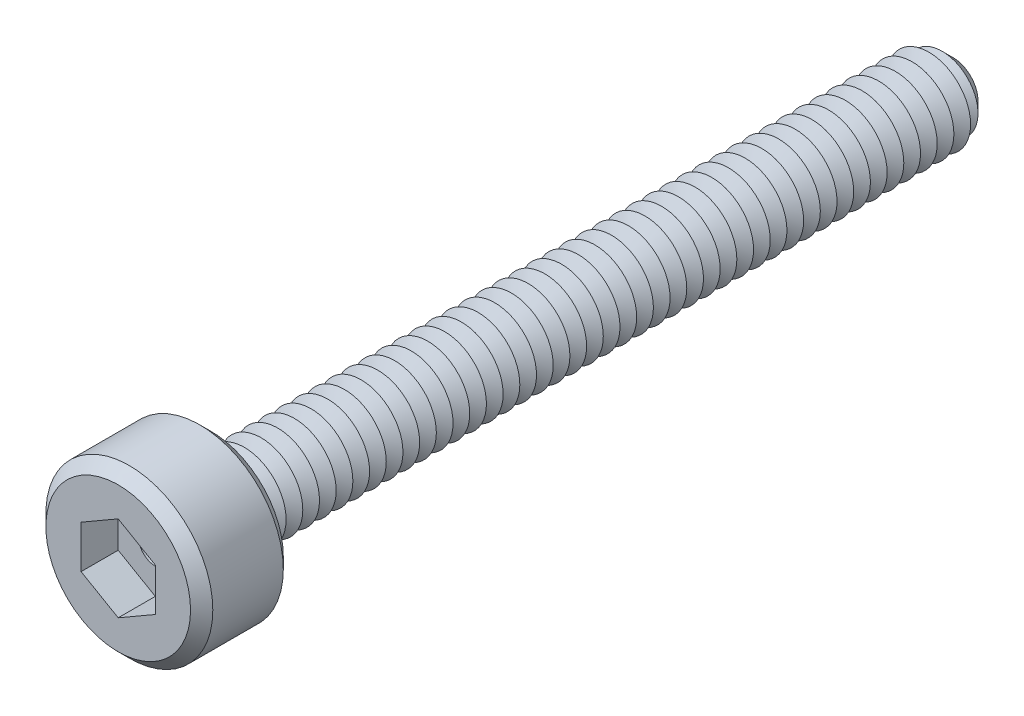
from build123d import *

# Parameters (mm, degrees)
SKETCH1_R           = 2.25
BOSS_EXTRUDE1_DEPTH = 2.5
SKETCH2_R           = 1.125
BOSS_EXTRUDE2_DEPTH = 20
CHAMFER1_SIZE       = 0.45
LPATTERN1_COUNT     = 44
LPATTERN1_PITCH     = 0.45
CUT_EXTRUDE1_DEPTH  = 1
SKETCH6_R           = 0.45
CUT_EXTRUDE2_DEPTH  = 21.5
CHAMFER2_SIZE       = 0.3


with BuildPart() as part:
    # Sketch1 → Boss-Extrude1 (new body)
    with BuildSketch(Plane.XY):
        Circle(SKETCH1_R)
    extrude(amount=BOSS_EXTRUDE1_DEPTH)

    # Sketch2 → Boss-Extrude2 (add)
    with BuildSketch(Plane(origin=(0, 0, 0), x_dir=(-1, 0, 0), z_dir=(0, 0, -1))):
        Circle(SKETCH2_R)
    extrude(amount=BOSS_EXTRUDE2_DEPTH)

    # Chamfer1
    chamfer1_edges = [part.edges().sort_by_distance(p)[0] for p in [
        (1.125, 0, -20),
    ]]
    chamfer(chamfer1_edges, length=CHAMFER1_SIZE)

    # Sketch4 → Cut-Revolve1 (revolve, cut)
    with BuildSketch(Plane(origin=(0, 0, 0), x_dir=(0, 0, -1), z_dir=(1, 0, 0)), mode=Mode.PRIVATE) as cut_revolve1_sk:
        Polygon((0, 1.125), (0.225, 0.735288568), (0.45, 1.125), align=None)
    cut_revolve1 = revolve(cut_revolve1_sk.sketch.rotate(Axis((0, 0, 2.512122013), (0, 0, -1)), 90), axis=Axis((0, 0, 2.512122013), (0, 0, -1)), mode=Mode.SUBTRACT)

    # LPattern1: Cut-Revolve1 ×44
    with Locations(*[(0, 0, -i * LPATTERN1_PITCH) for i in range(1, LPATTERN1_COUNT)]):
        add(cut_revolve1, mode=Mode.SUBTRACT)

    # Sketch5 → Cut-Extrude1 (cut)
    with BuildSketch(Plane.XY.offset(2.5)):
        Polygon((0, 1.154700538), (-1, 0.577350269), (-1, -0.577350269), (0, -1.154700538), (1, -0.577350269), (1, 0.577350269), align=None)
    extrude(amount=-CUT_EXTRUDE1_DEPTH, mode=Mode.SUBTRACT)

    # Sketch6 → Cut-Extrude2 (cut)
    with BuildSketch(Plane.XY.offset(1.5)):
        Circle(SKETCH6_R)
    extrude(amount=-CUT_EXTRUDE2_DEPTH, mode=Mode.SUBTRACT)

    # Chamfer2
    chamfer2_edges = [part.edges().sort_by_distance(p)[0] for p in [
        (-2.25, 0, 0),
        (-2.25, 0, 2.5),
    ]]
    chamfer(chamfer2_edges, length=CHAMFER2_SIZE)


solid = part.part
